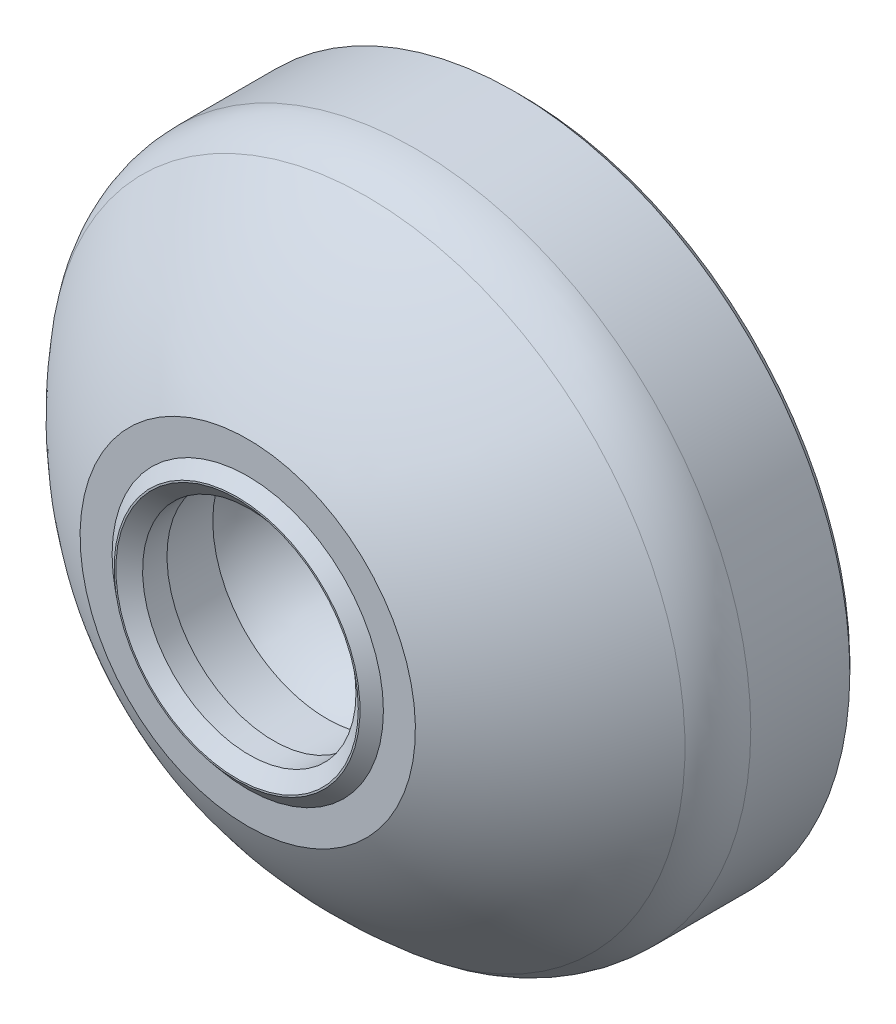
ISO-10303-21;
HEADER;
FILE_DESCRIPTION(('STEP AP214'),'2;1');
FILE_NAME('part.step','',(''),(''),'','','');
FILE_SCHEMA(('AUTOMOTIVE_DESIGN { 1 0 10303 214 1 1 1 1 }'));
ENDSEC;
DATA;
#1=APPLICATION_CONTEXT('core data for automotive mechanical design processes');
#2=APPLICATION_PROTOCOL_DEFINITION('international standard','automotive_design',2000,#1);
#3=PRODUCT_CONTEXT('',#1,'mechanical');
#4=PRODUCT('Part','Part','',(#3));
#5=PRODUCT_RELATED_PRODUCT_CATEGORY('part','',(#4));
#6=PRODUCT_DEFINITION_FORMATION('','',#4);
#7=PRODUCT_DEFINITION_CONTEXT('part definition',#1,'design');
#8=PRODUCT_DEFINITION('design','',#6,#7);
#9=PRODUCT_DEFINITION_SHAPE('','',#8);
#10=(LENGTH_UNIT() NAMED_UNIT(*) SI_UNIT(.MILLI.,.METRE.));
#11=(NAMED_UNIT(*) PLANE_ANGLE_UNIT() SI_UNIT($,.RADIAN.));
#12=(NAMED_UNIT(*) SI_UNIT($,.STERADIAN.) SOLID_ANGLE_UNIT());
#13=UNCERTAINTY_MEASURE_WITH_UNIT(LENGTH_MEASURE(1.E-05),#10,'distance_accuracy_value','');
#14=(GEOMETRIC_REPRESENTATION_CONTEXT(3) GLOBAL_UNCERTAINTY_ASSIGNED_CONTEXT((#13)) GLOBAL_UNIT_ASSIGNED_CONTEXT((#10,
#11,#12)) REPRESENTATION_CONTEXT('',''));
#15=CARTESIAN_POINT('',(0.,0.,0.));
#16=DIRECTION('',(0.,0.,1.));
#17=DIRECTION('',(1.,0.,0.));
#18=AXIS2_PLACEMENT_3D('',#15,#16,#17);
#19=CARTESIAN_POINT('',(2.48380206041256,-7.55784742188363,16.7359722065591));
#20=CARTESIAN_POINT('',(2.47331029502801,-7.55784742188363,16.7078917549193));
#21=CARTESIAN_POINT('',(2.46281852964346,-7.55784742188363,16.6798113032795));
#22=CARTESIAN_POINT('',(1.82431002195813,-7.55784742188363,14.9708894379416));
#23=CARTESIAN_POINT('',(0.,-7.55784742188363,14.9708894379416));
#24=CARTESIAN_POINT('',(-1.82431002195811,-7.55784742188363,14.9708894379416));
#25=CARTESIAN_POINT('',(-2.46281852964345,-7.55784742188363,16.6798113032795));
#26=CARTESIAN_POINT('',(-2.473310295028,-7.55784742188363,16.7078917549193));
#27=CARTESIAN_POINT('',(-2.48380206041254,-7.55784742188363,16.7359722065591));
#28=CARTESIAN_POINT('',(2.56452432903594,-7.52592250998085,16.7078917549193));
#29=CARTESIAN_POINT('',(2.55369158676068,-7.52592250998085,16.6788987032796));
#30=CARTESIAN_POINT('',(2.54285884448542,-7.52592250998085,16.6499056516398));
#31=CARTESIAN_POINT('',(1.88359914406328,-7.52592250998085,14.8854447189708));
#32=CARTESIAN_POINT('',(0.,-7.52592250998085,14.8854447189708));
#33=CARTESIAN_POINT('',(-1.88359914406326,-7.52592250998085,14.8854447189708));
#34=CARTESIAN_POINT('',(-2.54285884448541,-7.52592250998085,16.6499056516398));
#35=CARTESIAN_POINT('',(-2.55369158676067,-7.52592250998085,16.6788987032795));
#36=CARTESIAN_POINT('',(-2.56452432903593,-7.52592250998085,16.7078917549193));
#37=CARTESIAN_POINT('',(2.64524659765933,-7.49399759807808,16.6798113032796));
#38=CARTESIAN_POINT('',(2.63407287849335,-7.49399759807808,16.6499056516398));
#39=CARTESIAN_POINT('',(2.62289915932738,-7.49399759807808,16.62));
#40=CARTESIAN_POINT('',(1.94288826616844,-7.49399759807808,14.8));
#41=CARTESIAN_POINT('',(0.,-7.49399759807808,14.8));
#42=CARTESIAN_POINT('',(-1.94288826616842,-7.49399759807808,14.7999999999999));
#43=CARTESIAN_POINT('',(-2.62289915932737,-7.49399759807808,16.62));
#44=CARTESIAN_POINT('',(-2.63407287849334,-7.49399759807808,16.6499056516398));
#45=CARTESIAN_POINT('',(-2.64524659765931,-7.49399759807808,16.6798113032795));
#46=CARTESIAN_POINT('',(7.55784742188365,-5.55110933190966,14.9708894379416));
#47=CARTESIAN_POINT('',(7.52592250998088,-5.55110933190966,14.8854447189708));
#48=CARTESIAN_POINT('',(7.4939975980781,-5.55110933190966,14.8));
#49=CARTESIAN_POINT('',(5.55110933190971,-5.55110933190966,9.59999999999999));
#50=CARTESIAN_POINT('',(0.,-5.55110933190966,9.59999999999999));
#51=CARTESIAN_POINT('',(-5.55110933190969,-5.55110933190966,9.59999999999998));
#52=CARTESIAN_POINT('',(-7.49399759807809,-5.55110933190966,14.8));
#53=CARTESIAN_POINT('',(-7.52592250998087,-5.55110933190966,14.8854447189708));
#54=CARTESIAN_POINT('',(-7.55784742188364,-5.55110933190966,14.9708894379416));
#55=CARTESIAN_POINT('',(7.55784742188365,0.,14.9708894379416));
#56=CARTESIAN_POINT('',(7.52592250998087,0.,14.8854447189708));
#57=CARTESIAN_POINT('',(7.4939975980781,0.,14.8));
#58=CARTESIAN_POINT('',(5.55110933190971,0.,9.59999999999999));
#59=CARTESIAN_POINT('',(0.,0.,9.59999999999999));
#60=CARTESIAN_POINT('',(-5.55110933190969,0.,9.59999999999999));
#61=CARTESIAN_POINT('',(-7.49399759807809,0.,14.8));
#62=CARTESIAN_POINT('',(-7.52592250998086,0.,14.8854447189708));
#63=CARTESIAN_POINT('',(-7.55784742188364,0.,14.9708894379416));
#64=CARTESIAN_POINT('',(7.55784742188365,5.55110933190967,14.9708894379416));
#65=CARTESIAN_POINT('',(7.52592250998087,5.55110933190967,14.8854447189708));
#66=CARTESIAN_POINT('',(7.4939975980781,5.55110933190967,14.8));
#67=CARTESIAN_POINT('',(5.5511093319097,5.55110933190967,9.59999999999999));
#68=CARTESIAN_POINT('',(0.,5.55110933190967,9.59999999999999));
#69=CARTESIAN_POINT('',(-5.55110933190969,5.55110933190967,9.59999999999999));
#70=CARTESIAN_POINT('',(-7.49399759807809,5.55110933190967,14.8));
#71=CARTESIAN_POINT('',(-7.52592250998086,5.55110933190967,14.8854447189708));
#72=CARTESIAN_POINT('',(-7.55784742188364,5.55110933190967,14.9708894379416));
#73=CARTESIAN_POINT('',(2.64524659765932,7.49399759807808,16.6798113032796));
#74=CARTESIAN_POINT('',(2.63407287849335,7.49399759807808,16.6499056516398));
#75=CARTESIAN_POINT('',(2.62289915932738,7.49399759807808,16.62));
#76=CARTESIAN_POINT('',(1.94288826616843,7.49399759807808,14.8));
#77=CARTESIAN_POINT('',(0.,7.49399759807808,14.8));
#78=CARTESIAN_POINT('',(-1.94288826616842,7.49399759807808,14.8));
#79=CARTESIAN_POINT('',(-2.62289915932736,7.49399759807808,16.62));
#80=CARTESIAN_POINT('',(-2.63407287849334,7.49399759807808,16.6499056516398));
#81=CARTESIAN_POINT('',(-2.64524659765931,7.49399759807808,16.6798113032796));
#82=CARTESIAN_POINT('',(2.56452432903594,7.52592250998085,16.7078917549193));
#83=CARTESIAN_POINT('',(2.55369158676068,7.52592250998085,16.6788987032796));
#84=CARTESIAN_POINT('',(2.54285884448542,7.52592250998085,16.6499056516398));
#85=CARTESIAN_POINT('',(1.88359914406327,7.52592250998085,14.8854447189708));
#86=CARTESIAN_POINT('',(0.,7.52592250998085,14.8854447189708));
#87=CARTESIAN_POINT('',(-1.88359914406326,7.52592250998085,14.8854447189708));
#88=CARTESIAN_POINT('',(-2.54285884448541,7.52592250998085,16.6499056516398));
#89=CARTESIAN_POINT('',(-2.55369158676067,7.52592250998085,16.6788987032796));
#90=CARTESIAN_POINT('',(-2.56452432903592,7.52592250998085,16.7078917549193));
#91=CARTESIAN_POINT('',(2.48380206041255,7.55784742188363,16.7359722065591));
#92=CARTESIAN_POINT('',(2.473310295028,7.55784742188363,16.7078917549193));
#93=CARTESIAN_POINT('',(2.46281852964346,7.55784742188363,16.6798113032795));
#94=CARTESIAN_POINT('',(1.82431002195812,7.55784742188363,14.9708894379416));
#95=CARTESIAN_POINT('',(0.,7.55784742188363,14.9708894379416));
#96=CARTESIAN_POINT('',(-1.82431002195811,7.55784742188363,14.9708894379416));
#97=CARTESIAN_POINT('',(-2.46281852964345,7.55784742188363,16.6798113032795));
#98=CARTESIAN_POINT('',(-2.47331029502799,7.55784742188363,16.7078917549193));
#99=CARTESIAN_POINT('',(-2.48380206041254,7.55784742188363,16.7359722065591));
#100=(BOUNDED_SURFACE() B_SPLINE_SURFACE(2,2,((#19,#20,#21,#22,#23,#24,#25,#26,#27),(#28,#29,
#30,#31,#32,#33,#34,#35,#36),(#37,#38,#39,#40,#41,#42,#43,#44,#45),(#46,#47,#48,#49,#50,#51,#52,
#53,#54),(#55,#56,#57,#58,#59,#60,#61,#62,#63),(#64,#65,#66,#67,#68,#69,#70,#71,#72),(#73,#74,
#75,#76,#77,#78,#79,#80,#81),(#82,#83,#84,#85,#86,#87,#88,#89,#90),(#91,#92,#93,#94,#95,#96,#97,
#98,#99)),.UNSPECIFIED.,.F.,.F.,.F.) B_SPLINE_SURFACE_WITH_KNOTS((3,2,2,2,3),(3,2,2,2,3),
(-1.23748972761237,-1.21322522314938,0.,1.21322522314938,1.23748972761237),(-0.0242645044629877,
0.,1.21322522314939,2.42645044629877,2.45071495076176),
.UNSPECIFIED.) GEOMETRIC_REPRESENTATION_ITEM() RATIONAL_B_SPLINE_SURFACE(((1.,1.,1.,
0.821583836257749,1.,0.821583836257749,1.,1.,1.),(1.,1.,1.,0.821583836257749,1.,
0.821583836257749,1.,1.,1.),(1.,1.,1.,0.821583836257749,1.,0.821583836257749,1.,1.,1.),
(0.821583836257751,0.821583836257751,0.821583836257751,0.675000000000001,0.821583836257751,
0.675000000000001,0.821583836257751,0.821583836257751,0.821583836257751),(1.,1.,1.,
0.821583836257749,1.,0.821583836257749,1.,1.,1.),(0.82158383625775,0.82158383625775,
0.82158383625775,0.675000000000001,0.82158383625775,0.675000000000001,0.82158383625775,
0.82158383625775,0.82158383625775),(1.,1.,1.,0.821583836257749,1.,0.821583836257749,1.,1.,1.),
(1.,1.,1.,0.821583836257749,1.,0.821583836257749,1.,1.,1.),(1.,1.,1.,0.821583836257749,1.,
0.821583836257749,1.,1.,1.))) REPRESENTATION_ITEM('') SURFACE());
#101=CARTESIAN_POINT('',(0.,0.,14.8));
#102=DIRECTION('',(0.,0.,-1.));
#103=DIRECTION('',(0.,1.,0.));
#104=AXIS2_PLACEMENT_3D('',#101,#102,#103);
#105=CIRCLE('',#104,7.49399759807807);
#106=CARTESIAN_POINT('',(0.,7.49399759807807,14.8));
#107=VERTEX_POINT('',#106);
#108=EDGE_CURVE('E17',#107,#107,#105,.F.);
#109=ORIENTED_EDGE('',*,*,#108,.T.);
#110=EDGE_LOOP('',(#109));
#111=FACE_BOUND('',#110,.T.);
#112=ADVANCED_FACE('F13',(#111),#100,.T.);
#113=CARTESIAN_POINT('',(0.,0.,16.55));
#114=DIRECTION('',(0.,0.,-1.));
#115=DIRECTION('',(0.,1.,0.));
#116=AXIS2_PLACEMENT_3D('',#113,#114,#115);
#117=CYLINDRICAL_SURFACE('',#116,7.49399759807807);
#118=ORIENTED_EDGE('',*,*,#108,.F.);
#119=EDGE_LOOP('',(#118));
#120=FACE_BOUND('',#119,.T.);
#121=CARTESIAN_POINT('',(0.,0.,18.3));
#122=DIRECTION('',(0.,0.,-1.));
#123=DIRECTION('',(0.,1.,0.));
#124=AXIS2_PLACEMENT_3D('',#121,#122,#123);
#125=CIRCLE('',#124,7.49399759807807);
#126=CARTESIAN_POINT('',(0.,7.49399759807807,18.3));
#127=VERTEX_POINT('',#126);
#128=EDGE_CURVE('E54',#127,#127,#125,.T.);
#129=ORIENTED_EDGE('',*,*,#128,.F.);
#130=EDGE_LOOP('',(#129));
#131=FACE_BOUND('',#130,.T.);
#132=ADVANCED_FACE('F63',(#120,#131),#117,.F.);
#133=CARTESIAN_POINT('',(8.,0.,0.));
#134=DIRECTION('',(0.,0.,-1.));
#135=DIRECTION('',(-1.,0.,0.));
#136=AXIS2_PLACEMENT_3D('',#133,#134,#135);
#137=PLANE('',#136);
#138=CARTESIAN_POINT('',(0.,0.,0.));
#139=DIRECTION('',(0.,0.,1.));
#140=DIRECTION('',(1.,0.,0.));
#141=AXIS2_PLACEMENT_3D('',#138,#139,#140);
#142=CIRCLE('',#141,16.);
#143=CARTESIAN_POINT('',(16.,0.,0.));
#144=VERTEX_POINT('',#143);
#145=EDGE_CURVE('E53',#144,#144,#142,.T.);
#146=ORIENTED_EDGE('',*,*,#145,.F.);
#147=EDGE_LOOP('',(#146));
#148=FACE_BOUND('',#147,.T.);
#149=ADVANCED_FACE('F66',(#148),#137,.T.);
#150=CARTESIAN_POINT('',(7.24699879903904,0.,18.3));
#151=DIRECTION('',(0.,0.,-1.));
#152=DIRECTION('',(-1.,0.,0.));
#153=AXIS2_PLACEMENT_3D('',#150,#151,#152);
#154=PLANE('',#153);
#155=CARTESIAN_POINT('',(0.,0.,18.3));
#156=DIRECTION('',(0.,0.,-1.));
#157=DIRECTION('',(0.,1.,0.));
#158=AXIS2_PLACEMENT_3D('',#155,#156,#157);
#159=CIRCLE('',#158,7.);
#160=CARTESIAN_POINT('',(0.,7.,18.3));
#161=VERTEX_POINT('',#160);
#162=EDGE_CURVE('E51',#161,#161,#159,.F.);
#163=ORIENTED_EDGE('',*,*,#162,.T.);
#164=EDGE_LOOP('',(#163));
#165=FACE_BOUND('',#164,.T.);
#166=ORIENTED_EDGE('',*,*,#128,.T.);
#167=EDGE_LOOP('',(#166));
#168=FACE_BOUND('',#167,.T.);
#169=ADVANCED_FACE('F73',(#165,#168),#154,.T.);
#170=CARTESIAN_POINT('',(0.,0.,2.));
#171=DIRECTION('',(0.,0.,-1.));
#172=DIRECTION('',(0.,-1.,0.));
#173=AXIS2_PLACEMENT_3D('',#170,#171,#172);
#174=TOROIDAL_SURFACE('',#173,16.,2.);
#175=CARTESIAN_POINT('',(0.,0.,2.));
#176=DIRECTION('',(0.,0.,-1.));
#177=DIRECTION('',(0.,1.,0.));
#178=AXIS2_PLACEMENT_3D('',#175,#176,#177);
#179=CIRCLE('',#178,18.);
#180=CARTESIAN_POINT('',(0.,18.,2.));
#181=VERTEX_POINT('',#180);
#182=EDGE_CURVE('E48',#181,#181,#179,.F.);
#183=ORIENTED_EDGE('',*,*,#182,.F.);
#184=EDGE_LOOP('',(#183));
#185=FACE_BOUND('',#184,.T.);
#186=ORIENTED_EDGE('',*,*,#145,.T.);
#187=EDGE_LOOP('',(#186));
#188=FACE_BOUND('',#187,.T.);
#189=ADVANCED_FACE('F113',(#185,#188),#174,.T.);
#190=CARTESIAN_POINT('',(0.,0.,19.1));
#191=DIRECTION('',(0.,0.,-1.));
#192=DIRECTION('',(0.,1.,0.));
#193=AXIS2_PLACEMENT_3D('',#190,#191,#192);
#194=CYLINDRICAL_SURFACE('',#193,7.);
#195=ORIENTED_EDGE('',*,*,#162,.F.);
#196=EDGE_LOOP('',(#195));
#197=FACE_BOUND('',#196,.T.);
#198=CARTESIAN_POINT('',(0.,0.,19.8999999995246));
#199=DIRECTION('',(0.,0.,1.));
#200=DIRECTION('',(1.,0.,0.));
#201=AXIS2_PLACEMENT_3D('',#198,#199,#200);
#202=CIRCLE('',#201,7.00000000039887);
#203=CARTESIAN_POINT('',(7.00000000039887,0.,19.8999999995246));
#204=VERTEX_POINT('',#203);
#205=EDGE_CURVE('E47',#204,#204,#202,.T.);
#206=ORIENTED_EDGE('',*,*,#205,.T.);
#207=EDGE_LOOP('',(#206));
#208=FACE_BOUND('',#207,.T.);
#209=ADVANCED_FACE('F118',(#197,#208),#194,.F.);
#210=CARTESIAN_POINT('',(10.75,0.,2.));
#211=DIRECTION('',(0.,0.,-1.));
#212=DIRECTION('',(-1.,0.,0.));
#213=AXIS2_PLACEMENT_3D('',#210,#211,#212);
#214=PLANE('',#213);
#215=ORIENTED_EDGE('',*,*,#182,.T.);
#216=EDGE_LOOP('',(#215));
#217=FACE_BOUND('',#216,.T.);
#218=CARTESIAN_POINT('',(0.,0.,1.99999999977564));
#219=DIRECTION('',(0.,0.,1.));
#220=DIRECTION('',(0.,-1.,0.));
#221=AXIS2_PLACEMENT_3D('',#218,#219,#220);
#222=CIRCLE('',#221,21.5000000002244);
#223=CARTESIAN_POINT('',(0.,-21.5000000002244,1.99999999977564));
#224=VERTEX_POINT('',#223);
#225=EDGE_CURVE('E44',#224,#224,#222,.T.);
#226=ORIENTED_EDGE('',*,*,#225,.F.);
#227=EDGE_LOOP('',(#226));
#228=FACE_BOUND('',#227,.T.);
#229=ADVANCED_FACE('F138',(#217,#228),#214,.T.);
#230=CARTESIAN_POINT('',(0.,0.,20.7000000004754));
#231=DIRECTION('',(0.,0.,1.));
#232=DIRECTION('',(1.,0.,0.));
#233=AXIS2_PLACEMENT_3D('',#230,#231,#232);
#234=CONICAL_SURFACE('',#233,7.95340287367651,0.872664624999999);
#235=ORIENTED_EDGE('',*,*,#205,.F.);
#236=EDGE_LOOP('',(#235));
#237=FACE_BOUND('',#236,.T.);
#238=CARTESIAN_POINT('',(0.,0.,20.7000000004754));
#239=DIRECTION('',(0.,0.,1.));
#240=DIRECTION('',(1.,0.,0.));
#241=AXIS2_PLACEMENT_3D('',#238,#239,#240);
#242=CIRCLE('',#241,7.95340287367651);
#243=CARTESIAN_POINT('',(7.95340287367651,0.,20.7000000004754));
#244=VERTEX_POINT('',#243);
#245=EDGE_CURVE('E41',#244,#244,#242,.F.);
#246=ORIENTED_EDGE('',*,*,#245,.F.);
#247=EDGE_LOOP('',(#246));
#248=FACE_BOUND('',#247,.T.);
#249=ADVANCED_FACE('F141',(#237,#248),#234,.F.);
#250=CARTESIAN_POINT('',(0.,0.,2.50000000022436));
#251=DIRECTION('',(0.,0.,1.));
#252=DIRECTION('',(0.,-1.,0.));
#253=AXIS2_PLACEMENT_3D('',#250,#251,#252);
#254=CONICAL_SURFACE('',#253,21.9999999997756,0.7853981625);
#255=CARTESIAN_POINT('',(0.,0.,2.5));
#256=DIRECTION('',(0.,0.,-1.));
#257=DIRECTION('',(0.,1.,0.));
#258=AXIS2_PLACEMENT_3D('',#255,#256,#257);
#259=CIRCLE('',#258,22.);
#260=CARTESIAN_POINT('',(0.,22.,2.49999999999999));
#261=VERTEX_POINT('',#260);
#262=EDGE_CURVE('E40',#261,#261,#259,.F.);
#263=ORIENTED_EDGE('',*,*,#262,.F.);
#264=EDGE_LOOP('',(#263));
#265=FACE_BOUND('',#264,.T.);
#266=ORIENTED_EDGE('',*,*,#225,.T.);
#267=EDGE_LOOP('',(#266));
#268=FACE_BOUND('',#267,.T.);
#269=ADVANCED_FACE('F144',(#265,#268),#254,.T.);
#270=CARTESIAN_POINT('',(8.00958767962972,0.,20.7));
#271=DIRECTION('',(0.,0.,1.));
#272=DIRECTION('',(1.,0.,0.));
#273=AXIS2_PLACEMENT_3D('',#270,#271,#272);
#274=PLANE('',#273);
#275=ORIENTED_EDGE('',*,*,#245,.T.);
#276=EDGE_LOOP('',(#275));
#277=FACE_BOUND('',#276,.T.);
#278=CARTESIAN_POINT('',(0.,0.,20.7000000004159));
#279=DIRECTION('',(0.,0.,-1.));
#280=DIRECTION('',(0.,1.,0.));
#281=AXIS2_PLACEMENT_3D('',#278,#279,#280);
#282=CIRCLE('',#281,8.06577248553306);
#283=CARTESIAN_POINT('',(0.,8.06577248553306,20.7000000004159));
#284=VERTEX_POINT('',#283);
#285=EDGE_CURVE('E37',#284,#284,#282,.T.);
#286=ORIENTED_EDGE('',*,*,#285,.F.);
#287=EDGE_LOOP('',(#286));
#288=FACE_BOUND('',#287,.T.);
#289=ADVANCED_FACE('F148',(#277,#288),#274,.T.);
#290=CARTESIAN_POINT('',(0.,0.,5.74903945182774));
#291=DIRECTION('',(0.,0.,-1.));
#292=DIRECTION('',(0.,1.,0.));
#293=AXIS2_PLACEMENT_3D('',#290,#291,#292);
#294=CYLINDRICAL_SURFACE('',#293,22.);
#295=CARTESIAN_POINT('',(0.,0.,8.99807890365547));
#296=DIRECTION('',(0.,0.,-1.));
#297=DIRECTION('',(0.,-1.,0.));
#298=AXIS2_PLACEMENT_3D('',#295,#296,#297);
#299=CIRCLE('',#298,22.);
#300=CARTESIAN_POINT('',(0.,-22.,8.99807890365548));
#301=VERTEX_POINT('',#300);
#302=EDGE_CURVE('E36',#301,#301,#299,.F.);
#303=ORIENTED_EDGE('',*,*,#302,.F.);
#304=EDGE_LOOP('',(#303));
#305=FACE_BOUND('',#304,.T.);
#306=ORIENTED_EDGE('',*,*,#262,.T.);
#307=EDGE_LOOP('',(#306));
#308=FACE_BOUND('',#307,.T.);
#309=ADVANCED_FACE('F151',(#305,#308),#294,.T.);
#310=CARTESIAN_POINT('',(0.,0.,19.9999999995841));
#311=DIRECTION('',(0.,0.,-1.));
#312=DIRECTION('',(0.,1.,0.));
#313=AXIS2_PLACEMENT_3D('',#310,#311,#312);
#314=CONICAL_SURFACE('',#313,8.89999999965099,0.872664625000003);
#315=ORIENTED_EDGE('',*,*,#285,.T.);
#316=EDGE_LOOP('',(#315));
#317=FACE_BOUND('',#316,.T.);
#318=CARTESIAN_POINT('',(0.,0.,19.9999999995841));
#319=DIRECTION('',(0.,0.,-1.));
#320=DIRECTION('',(0.,1.,0.));
#321=AXIS2_PLACEMENT_3D('',#318,#319,#320);
#322=CIRCLE('',#321,8.89999999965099);
#323=CARTESIAN_POINT('',(0.,8.89999999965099,19.9999999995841));
#324=VERTEX_POINT('',#323);
#325=EDGE_CURVE('E26',#324,#324,#322,.T.);
#326=ORIENTED_EDGE('',*,*,#325,.F.);
#327=EDGE_LOOP('',(#326));
#328=FACE_BOUND('',#327,.T.);
#329=ADVANCED_FACE('F89',(#317,#328),#314,.T.);
#330=CARTESIAN_POINT('',(0.,0.,8.99807890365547));
#331=DIRECTION('',(0.,0.,-1.));
#332=DIRECTION('',(0.,-1.,0.));
#333=AXIS2_PLACEMENT_3D('',#330,#331,#332);
#334=TOROIDAL_SURFACE('',#333,17.,5.00000000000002);
#335=CARTESIAN_POINT('',(0.,0.,12.1755911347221));
#336=DIRECTION('',(0.,0.,1.));
#337=DIRECTION('',(0.,-1.,0.));
#338=AXIS2_PLACEMENT_3D('',#335,#336,#337);
#339=CIRCLE('',#338,20.8604942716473);
#340=CARTESIAN_POINT('',(0.,-20.8604942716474,12.1755911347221));
#341=VERTEX_POINT('',#340);
#342=EDGE_CURVE('E21',#341,#341,#339,.T.);
#343=ORIENTED_EDGE('',*,*,#342,.F.);
#344=EDGE_LOOP('',(#343));
#345=FACE_BOUND('',#344,.T.);
#346=ORIENTED_EDGE('',*,*,#302,.T.);
#347=EDGE_LOOP('',(#346));
#348=FACE_BOUND('',#347,.T.);
#349=ADVANCED_FACE('F81',(#345,#348),#334,.T.);
#350=CARTESIAN_POINT('',(9.95000000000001,0.,20.));
#351=DIRECTION('',(0.,0.,1.));
#352=DIRECTION('',(1.,0.,0.));
#353=AXIS2_PLACEMENT_3D('',#350,#351,#352);
#354=PLANE('',#353);
#355=ORIENTED_EDGE('',*,*,#325,.T.);
#356=EDGE_LOOP('',(#355));
#357=FACE_BOUND('',#356,.T.);
#358=CARTESIAN_POINT('',(0.,0.,20.));
#359=DIRECTION('',(0.,0.,1.));
#360=DIRECTION('',(0.,-1.,0.));
#361=AXIS2_PLACEMENT_3D('',#358,#359,#360);
#362=CIRCLE('',#361,11.);
#363=CARTESIAN_POINT('',(0.,-11.,20.));
#364=VERTEX_POINT('',#363);
#365=EDGE_CURVE('E9',#364,#364,#362,.F.);
#366=ORIENTED_EDGE('',*,*,#365,.F.);
#367=EDGE_LOOP('',(#366));
#368=FACE_BOUND('',#367,.T.);
#369=ADVANCED_FACE('F77',(#357,#368),#354,.T.);
#370=CARTESIAN_POINT('',(0.,0.,-6.88948225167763));
#371=DIRECTION('',(0.,0.,1.));
#372=DIRECTION('',(0.,-1.,0.));
#373=AXIS2_PLACEMENT_3D('',#370,#371,#372);
#374=DEGENERATE_TOROIDAL_SURFACE('',#373,2.30247135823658,29.9999999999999,.F.);
#375=ORIENTED_EDGE('',*,*,#365,.T.);
#376=EDGE_LOOP('',(#375));
#377=FACE_BOUND('',#376,.T.);
#378=ORIENTED_EDGE('',*,*,#342,.T.);
#379=EDGE_LOOP('',(#378));
#380=FACE_BOUND('',#379,.T.);
#381=ADVANCED_FACE('F15',(#377,#380),#374,.F.);
#382=CLOSED_SHELL('',(#112,#132,#149,#169,#189,#209,#229,#249,#269,#289,#309,#329,#349,#369,#381));
#383=MANIFOLD_SOLID_BREP('B1',#382);
#384=ADVANCED_BREP_SHAPE_REPRESENTATION('',(#18,#383),#14);
#385=SHAPE_DEFINITION_REPRESENTATION(#9,#384);
ENDSEC;
END-ISO-10303-21;
